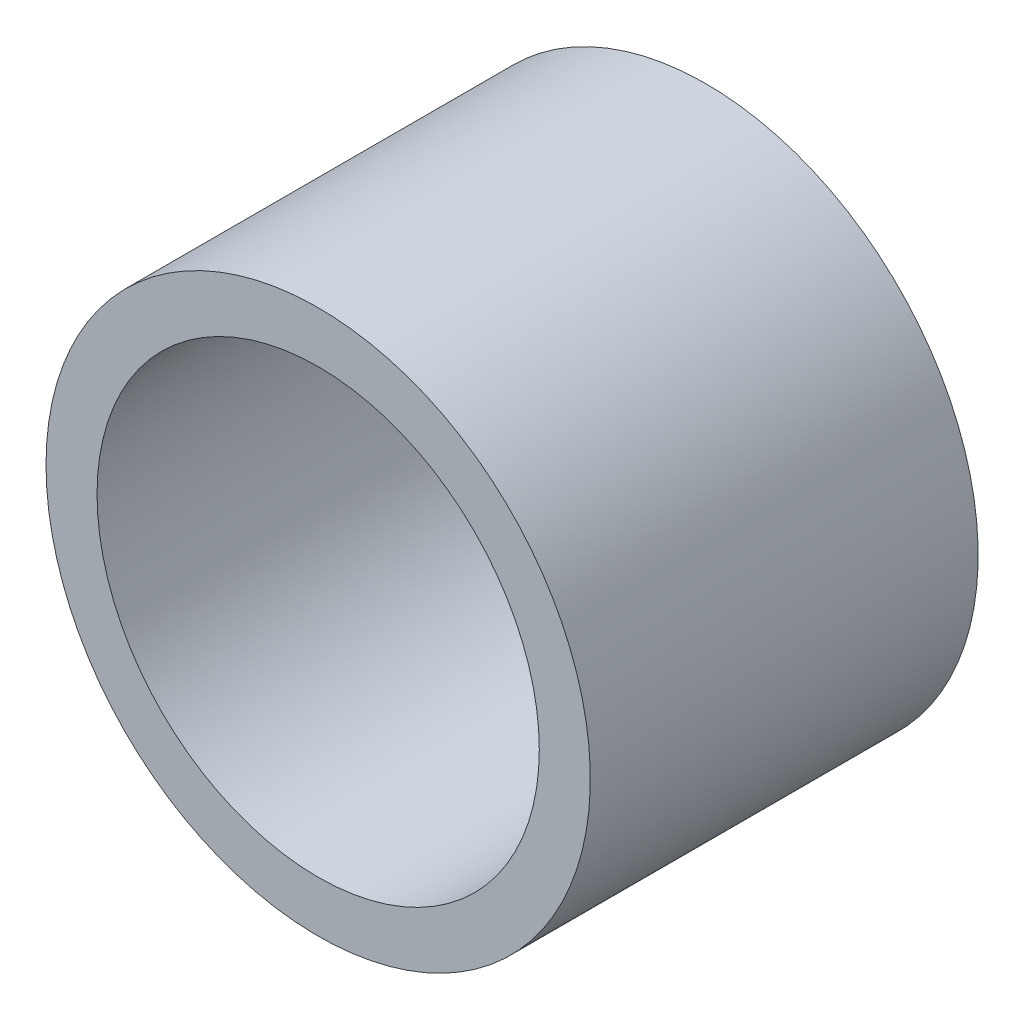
ISO-10303-21;
HEADER;
FILE_DESCRIPTION(('STEP AP214'),'2;1');
FILE_NAME('part.step','',(''),(''),'','','');
FILE_SCHEMA(('AUTOMOTIVE_DESIGN { 1 0 10303 214 1 1 1 1 }'));
ENDSEC;
DATA;
#1=APPLICATION_CONTEXT('core data for automotive mechanical design processes');
#2=APPLICATION_PROTOCOL_DEFINITION('international standard','automotive_design',2000,#1);
#3=PRODUCT_CONTEXT('',#1,'mechanical');
#4=PRODUCT('Part','Part','',(#3));
#5=PRODUCT_RELATED_PRODUCT_CATEGORY('part','',(#4));
#6=PRODUCT_DEFINITION_FORMATION('','',#4);
#7=PRODUCT_DEFINITION_CONTEXT('part definition',#1,'design');
#8=PRODUCT_DEFINITION('design','',#6,#7);
#9=PRODUCT_DEFINITION_SHAPE('','',#8);
#10=(LENGTH_UNIT() NAMED_UNIT(*) SI_UNIT(.MILLI.,.METRE.));
#11=(NAMED_UNIT(*) PLANE_ANGLE_UNIT() SI_UNIT($,.RADIAN.));
#12=(NAMED_UNIT(*) SI_UNIT($,.STERADIAN.) SOLID_ANGLE_UNIT());
#13=UNCERTAINTY_MEASURE_WITH_UNIT(LENGTH_MEASURE(1.E-05),#10,'distance_accuracy_value','');
#14=(GEOMETRIC_REPRESENTATION_CONTEXT(3) GLOBAL_UNCERTAINTY_ASSIGNED_CONTEXT((#13)) GLOBAL_UNIT_ASSIGNED_CONTEXT((#10,
#11,#12)) REPRESENTATION_CONTEXT('',''));
#15=CARTESIAN_POINT('',(0.,0.,0.));
#16=DIRECTION('',(0.,0.,1.));
#17=DIRECTION('',(1.,0.,0.));
#18=AXIS2_PLACEMENT_3D('',#15,#16,#17);
#19=CARTESIAN_POINT('',(0.,0.,28.5));
#20=DIRECTION('',(0.,0.,1.));
#21=DIRECTION('',(1.,0.,0.));
#22=AXIS2_PLACEMENT_3D('',#19,#20,#21);
#23=PLANE('',#22);
#24=CARTESIAN_POINT('',(0.,0.,28.5));
#25=DIRECTION('',(0.,0.,1.));
#26=DIRECTION('',(1.,0.,0.));
#27=AXIS2_PLACEMENT_3D('',#24,#25,#26);
#28=CIRCLE('',#27,20.);
#29=CARTESIAN_POINT('',(-20.,0.,28.5));
#30=VERTEX_POINT('',#29);
#31=EDGE_CURVE('E10',#30,#30,#28,.T.);
#32=ORIENTED_EDGE('',*,*,#31,.T.);
#33=EDGE_LOOP('',(#32));
#34=FACE_BOUND('',#33,.T.);
#35=CARTESIAN_POINT('',(0.,0.,28.5));
#36=DIRECTION('',(0.,0.,1.));
#37=DIRECTION('',(1.,0.,0.));
#38=AXIS2_PLACEMENT_3D('',#35,#36,#37);
#39=CIRCLE('',#38,16.25);
#40=CARTESIAN_POINT('',(-16.25,0.,28.5));
#41=VERTEX_POINT('',#40);
#42=EDGE_CURVE('E42',#41,#41,#39,.T.);
#43=ORIENTED_EDGE('',*,*,#42,.F.);
#44=EDGE_LOOP('',(#43));
#45=FACE_BOUND('',#44,.T.);
#46=ADVANCED_FACE('F31',(#34,#45),#23,.T.);
#47=CARTESIAN_POINT('',(0.,0.,0.));
#48=DIRECTION('',(0.,0.,1.));
#49=DIRECTION('',(1.,0.,0.));
#50=AXIS2_PLACEMENT_3D('',#47,#48,#49);
#51=PLANE('',#50);
#52=CARTESIAN_POINT('',(0.,0.,0.));
#53=DIRECTION('',(0.,0.,1.));
#54=DIRECTION('',(1.,0.,0.));
#55=AXIS2_PLACEMENT_3D('',#52,#53,#54);
#56=CIRCLE('',#55,20.);
#57=CARTESIAN_POINT('',(-20.,0.,0.));
#58=VERTEX_POINT('',#57);
#59=EDGE_CURVE('E35',#58,#58,#56,.T.);
#60=ORIENTED_EDGE('',*,*,#59,.F.);
#61=EDGE_LOOP('',(#60));
#62=FACE_BOUND('',#61,.T.);
#63=CARTESIAN_POINT('',(0.,0.,0.));
#64=DIRECTION('',(0.,0.,1.));
#65=DIRECTION('',(1.,0.,0.));
#66=AXIS2_PLACEMENT_3D('',#63,#64,#65);
#67=CIRCLE('',#66,16.25);
#68=CARTESIAN_POINT('',(-16.25,0.,0.));
#69=VERTEX_POINT('',#68);
#70=EDGE_CURVE('E44',#69,#69,#67,.T.);
#71=ORIENTED_EDGE('',*,*,#70,.T.);
#72=EDGE_LOOP('',(#71));
#73=FACE_BOUND('',#72,.T.);
#74=ADVANCED_FACE('F54',(#62,#73),#51,.F.);
#75=CARTESIAN_POINT('',(0.,0.,28.5));
#76=DIRECTION('',(0.,0.,-1.));
#77=DIRECTION('',(-1.,0.,0.));
#78=AXIS2_PLACEMENT_3D('',#75,#76,#77);
#79=CYLINDRICAL_SURFACE('',#78,20.);
#80=CARTESIAN_POINT('',(-20.,0.,28.5));
#81=CARTESIAN_POINT('',(-20.,0.,28.203125));
#82=CARTESIAN_POINT('',(-20.,0.,27.90625));
#83=CARTESIAN_POINT('',(-20.,0.,27.3125));
#84=CARTESIAN_POINT('',(-20.,0.,27.015625));
#85=CARTESIAN_POINT('',(-20.,0.,26.421875));
#86=CARTESIAN_POINT('',(-20.,0.,26.125));
#87=CARTESIAN_POINT('',(-20.,0.,25.53125));
#88=CARTESIAN_POINT('',(-20.,0.,25.234375));
#89=CARTESIAN_POINT('',(-20.,0.,24.640625));
#90=CARTESIAN_POINT('',(-20.,0.,24.34375));
#91=CARTESIAN_POINT('',(-20.,0.,23.75));
#92=CARTESIAN_POINT('',(-20.,0.,23.453125));
#93=CARTESIAN_POINT('',(-20.,0.,22.859375));
#94=CARTESIAN_POINT('',(-20.,0.,22.5625));
#95=CARTESIAN_POINT('',(-20.,0.,21.96875));
#96=CARTESIAN_POINT('',(-20.,0.,21.671875));
#97=CARTESIAN_POINT('',(-20.,0.,21.078125));
#98=CARTESIAN_POINT('',(-20.,0.,20.78125));
#99=CARTESIAN_POINT('',(-20.,0.,20.1875));
#100=CARTESIAN_POINT('',(-20.,0.,19.890625));
#101=CARTESIAN_POINT('',(-20.,0.,19.296875));
#102=CARTESIAN_POINT('',(-20.,0.,19.));
#103=CARTESIAN_POINT('',(-20.,0.,18.40625));
#104=CARTESIAN_POINT('',(-20.,0.,18.109375));
#105=CARTESIAN_POINT('',(-20.,0.,17.515625));
#106=CARTESIAN_POINT('',(-20.,0.,17.21875));
#107=CARTESIAN_POINT('',(-20.,0.,16.625));
#108=CARTESIAN_POINT('',(-20.,0.,16.328125));
#109=CARTESIAN_POINT('',(-20.,0.,15.734375));
#110=CARTESIAN_POINT('',(-20.,0.,15.4375));
#111=CARTESIAN_POINT('',(-20.,0.,14.84375));
#112=CARTESIAN_POINT('',(-20.,0.,14.546875));
#113=CARTESIAN_POINT('',(-20.,0.,13.953125));
#114=CARTESIAN_POINT('',(-20.,0.,13.65625));
#115=CARTESIAN_POINT('',(-20.,0.,13.0625));
#116=CARTESIAN_POINT('',(-20.,0.,12.765625));
#117=CARTESIAN_POINT('',(-20.,0.,12.171875));
#118=CARTESIAN_POINT('',(-20.,0.,11.875));
#119=CARTESIAN_POINT('',(-20.,0.,11.28125));
#120=CARTESIAN_POINT('',(-20.,0.,10.984375));
#121=CARTESIAN_POINT('',(-20.,0.,10.390625));
#122=CARTESIAN_POINT('',(-20.,0.,10.09375));
#123=CARTESIAN_POINT('',(-20.,0.,9.5));
#124=CARTESIAN_POINT('',(-20.,0.,9.203125));
#125=CARTESIAN_POINT('',(-20.,0.,8.609375));
#126=CARTESIAN_POINT('',(-20.,0.,8.3125));
#127=CARTESIAN_POINT('',(-20.,0.,7.71875));
#128=CARTESIAN_POINT('',(-20.,0.,7.421875));
#129=CARTESIAN_POINT('',(-20.,0.,6.828125));
#130=CARTESIAN_POINT('',(-20.,0.,6.53125));
#131=CARTESIAN_POINT('',(-20.,0.,5.9375));
#132=CARTESIAN_POINT('',(-20.,0.,5.640625));
#133=CARTESIAN_POINT('',(-20.,0.,5.046875));
#134=CARTESIAN_POINT('',(-20.,0.,4.75));
#135=CARTESIAN_POINT('',(-20.,0.,4.15625));
#136=CARTESIAN_POINT('',(-20.,0.,3.859375));
#137=CARTESIAN_POINT('',(-20.,0.,3.265625));
#138=CARTESIAN_POINT('',(-20.,0.,2.96875));
#139=CARTESIAN_POINT('',(-20.,0.,2.375));
#140=CARTESIAN_POINT('',(-20.,0.,2.078125));
#141=CARTESIAN_POINT('',(-20.,0.,1.484375));
#142=CARTESIAN_POINT('',(-20.,0.,1.1875));
#143=CARTESIAN_POINT('',(-20.,0.,0.593749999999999));
#144=CARTESIAN_POINT('',(-20.,0.,0.296875));
#145=CARTESIAN_POINT('',(-20.,0.,0.));
#146=B_SPLINE_CURVE_WITH_KNOTS('',3,(#80,#81,#82,#83,#84,#85,#86,#87,#88,#89,#90,#91,#92,#93,
#94,#95,#96,#97,#98,#99,#100,#101,#102,#103,#104,#105,#106,#107,#108,#109,#110,#111,#112,#113,
#114,#115,#116,#117,#118,#119,#120,#121,#122,#123,#124,#125,#126,#127,#128,#129,#130,#131,#132,
#133,#134,#135,#136,#137,#138,#139,#140,#141,#142,#143,#144,#145),.UNSPECIFIED.,.F.,.F.,(4,2,2,
2,2,2,2,2,2,2,2,2,2,2,2,2,2,2,2,2,2,2,2,2,2,2,2,2,2,2,2,2,4),(0.,0.890625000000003,1.78125,
2.671875,3.5625,4.453125,5.34375,6.234375,7.125,8.015625,8.90625,9.796875,10.6875,11.578125,
12.46875,13.359375,14.25,15.140625,16.03125,16.921875,17.8125,18.703125,19.59375,20.484375,
21.375,22.265625,23.15625,24.046875,24.9375,25.828125,26.71875,27.609375,28.5),.UNSPECIFIED.);
#147=EDGE_CURVE('BSEAM33',#30,#58,#146,.T.);
#148=ORIENTED_EDGE('',*,*,#31,.F.);
#149=ORIENTED_EDGE('',*,*,#59,.T.);
#150=ORIENTED_EDGE('',*,*,#147,.T.);
#151=ORIENTED_EDGE('',*,*,#147,.F.);
#152=EDGE_LOOP('',(#148,#150,#149,#151));
#153=FACE_BOUND('',#152,.T.);
#154=ADVANCED_FACE('F33',(#153),#79,.T.);
#155=CARTESIAN_POINT('',(0.,0.,28.5));
#156=DIRECTION('',(0.,0.,-1.));
#157=DIRECTION('',(-1.,0.,0.));
#158=AXIS2_PLACEMENT_3D('',#155,#156,#157);
#159=CYLINDRICAL_SURFACE('',#158,16.25);
#160=CARTESIAN_POINT('',(-16.25,0.,28.5));
#161=CARTESIAN_POINT('',(-16.25,0.,28.203125));
#162=CARTESIAN_POINT('',(-16.25,0.,27.90625));
#163=CARTESIAN_POINT('',(-16.25,0.,27.3125));
#164=CARTESIAN_POINT('',(-16.25,0.,27.015625));
#165=CARTESIAN_POINT('',(-16.25,0.,26.421875));
#166=CARTESIAN_POINT('',(-16.25,0.,26.125));
#167=CARTESIAN_POINT('',(-16.25,0.,25.53125));
#168=CARTESIAN_POINT('',(-16.25,0.,25.234375));
#169=CARTESIAN_POINT('',(-16.25,0.,24.640625));
#170=CARTESIAN_POINT('',(-16.25,0.,24.34375));
#171=CARTESIAN_POINT('',(-16.25,0.,23.75));
#172=CARTESIAN_POINT('',(-16.25,0.,23.453125));
#173=CARTESIAN_POINT('',(-16.25,0.,22.859375));
#174=CARTESIAN_POINT('',(-16.25,0.,22.5625));
#175=CARTESIAN_POINT('',(-16.25,0.,21.96875));
#176=CARTESIAN_POINT('',(-16.25,0.,21.671875));
#177=CARTESIAN_POINT('',(-16.25,0.,21.078125));
#178=CARTESIAN_POINT('',(-16.25,0.,20.78125));
#179=CARTESIAN_POINT('',(-16.25,0.,20.1875));
#180=CARTESIAN_POINT('',(-16.25,0.,19.890625));
#181=CARTESIAN_POINT('',(-16.25,0.,19.296875));
#182=CARTESIAN_POINT('',(-16.25,0.,19.));
#183=CARTESIAN_POINT('',(-16.25,0.,18.40625));
#184=CARTESIAN_POINT('',(-16.25,0.,18.109375));
#185=CARTESIAN_POINT('',(-16.25,0.,17.515625));
#186=CARTESIAN_POINT('',(-16.25,0.,17.21875));
#187=CARTESIAN_POINT('',(-16.25,0.,16.625));
#188=CARTESIAN_POINT('',(-16.25,0.,16.328125));
#189=CARTESIAN_POINT('',(-16.25,0.,15.734375));
#190=CARTESIAN_POINT('',(-16.25,0.,15.4375));
#191=CARTESIAN_POINT('',(-16.25,0.,14.84375));
#192=CARTESIAN_POINT('',(-16.25,0.,14.546875));
#193=CARTESIAN_POINT('',(-16.25,0.,13.953125));
#194=CARTESIAN_POINT('',(-16.25,0.,13.65625));
#195=CARTESIAN_POINT('',(-16.25,0.,13.0625));
#196=CARTESIAN_POINT('',(-16.25,0.,12.765625));
#197=CARTESIAN_POINT('',(-16.25,0.,12.171875));
#198=CARTESIAN_POINT('',(-16.25,0.,11.875));
#199=CARTESIAN_POINT('',(-16.25,0.,11.28125));
#200=CARTESIAN_POINT('',(-16.25,0.,10.984375));
#201=CARTESIAN_POINT('',(-16.25,0.,10.390625));
#202=CARTESIAN_POINT('',(-16.25,0.,10.09375));
#203=CARTESIAN_POINT('',(-16.25,0.,9.5));
#204=CARTESIAN_POINT('',(-16.25,0.,9.203125));
#205=CARTESIAN_POINT('',(-16.25,0.,8.609375));
#206=CARTESIAN_POINT('',(-16.25,0.,8.3125));
#207=CARTESIAN_POINT('',(-16.25,0.,7.71875));
#208=CARTESIAN_POINT('',(-16.25,0.,7.421875));
#209=CARTESIAN_POINT('',(-16.25,0.,6.828125));
#210=CARTESIAN_POINT('',(-16.25,0.,6.53125));
#211=CARTESIAN_POINT('',(-16.25,0.,5.9375));
#212=CARTESIAN_POINT('',(-16.25,0.,5.640625));
#213=CARTESIAN_POINT('',(-16.25,0.,5.046875));
#214=CARTESIAN_POINT('',(-16.25,0.,4.75));
#215=CARTESIAN_POINT('',(-16.25,0.,4.15625));
#216=CARTESIAN_POINT('',(-16.25,0.,3.859375));
#217=CARTESIAN_POINT('',(-16.25,0.,3.265625));
#218=CARTESIAN_POINT('',(-16.25,0.,2.96875));
#219=CARTESIAN_POINT('',(-16.25,0.,2.375));
#220=CARTESIAN_POINT('',(-16.25,0.,2.078125));
#221=CARTESIAN_POINT('',(-16.25,0.,1.484375));
#222=CARTESIAN_POINT('',(-16.25,0.,1.1875));
#223=CARTESIAN_POINT('',(-16.25,0.,0.593749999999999));
#224=CARTESIAN_POINT('',(-16.25,0.,0.296875));
#225=CARTESIAN_POINT('',(-16.25,0.,0.));
#226=B_SPLINE_CURVE_WITH_KNOTS('',3,(#160,#161,#162,#163,#164,#165,#166,#167,#168,#169,#170,
#171,#172,#173,#174,#175,#176,#177,#178,#179,#180,#181,#182,#183,#184,#185,#186,#187,#188,#189,
#190,#191,#192,#193,#194,#195,#196,#197,#198,#199,#200,#201,#202,#203,#204,#205,#206,#207,#208,
#209,#210,#211,#212,#213,#214,#215,#216,#217,#218,#219,#220,#221,#222,#223,#224,#225),
.UNSPECIFIED.,.F.,.F.,(4,2,2,2,2,2,2,2,2,2,2,2,2,2,2,2,2,2,2,2,2,2,2,2,2,2,2,2,2,2,2,2,4),(0.,
0.890624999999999,1.78125,2.671875,3.5625,4.453125,5.34375,6.234375,7.125,8.015625,8.90625,
9.796875,10.6875,11.578125,12.46875,13.359375,14.25,15.140625,16.03125,16.921875,17.8125,
18.703125,19.59375,20.484375,21.375,22.265625,23.15625,24.046875,24.9375,25.828125,26.71875,
27.609375,28.5),.UNSPECIFIED.);
#227=EDGE_CURVE('BSEAM50',#41,#69,#226,.T.);
#228=ORIENTED_EDGE('',*,*,#42,.T.);
#229=ORIENTED_EDGE('',*,*,#70,.F.);
#230=ORIENTED_EDGE('',*,*,#227,.T.);
#231=ORIENTED_EDGE('',*,*,#227,.F.);
#232=EDGE_LOOP('',(#228,#230,#229,#231));
#233=FACE_BOUND('',#232,.T.);
#234=ADVANCED_FACE('F50',(#233),#159,.F.);
#235=CLOSED_SHELL('',(#46,#74,#154,#234));
#236=MANIFOLD_SOLID_BREP('B2',#235);
#237=ADVANCED_BREP_SHAPE_REPRESENTATION('',(#18,#236),#14);
#238=SHAPE_DEFINITION_REPRESENTATION(#9,#237);
ENDSEC;
END-ISO-10303-21;
